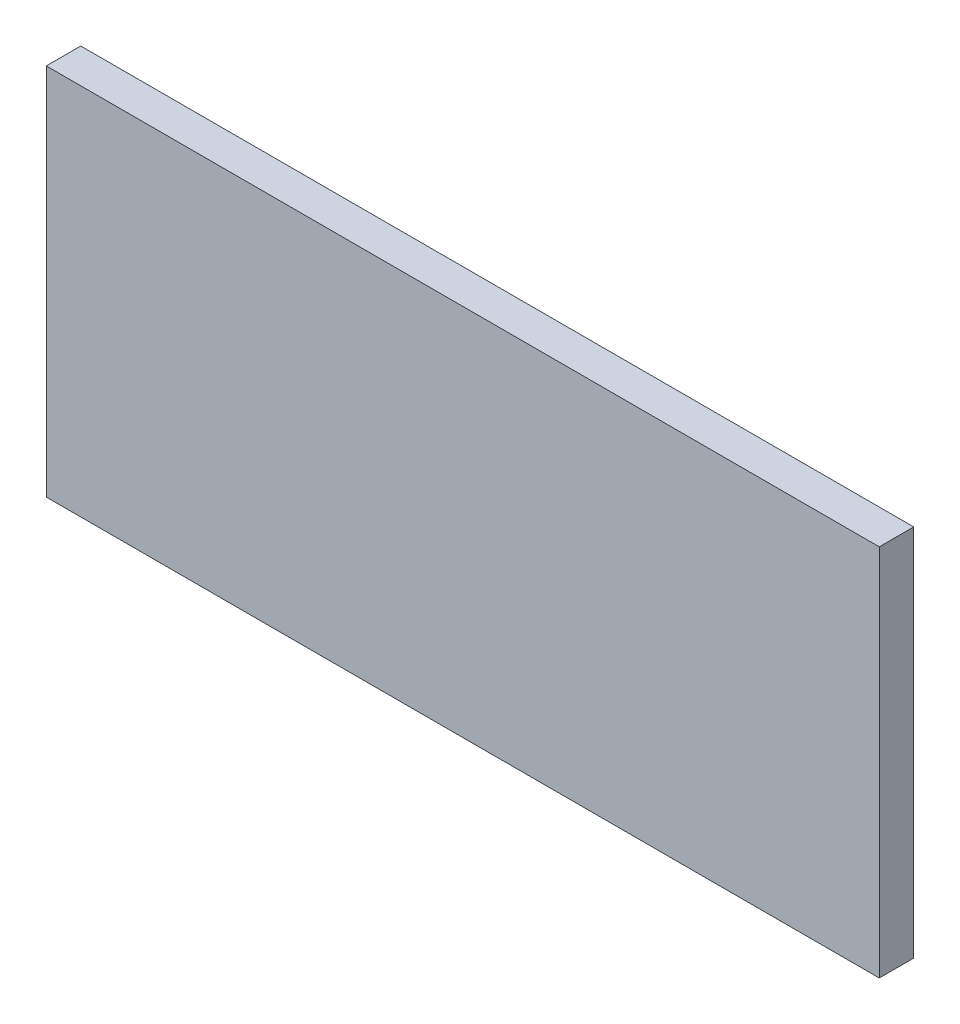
from build123d import *

# Parameters (mm, degrees)
ESQUISSE1_W      = 290
ESQUISSE1_H      = 130
EXTRUSION1_DEPTH = 12


with BuildPart() as part:
    # Esquisse1 → Extrusion1 (new body)
    with BuildSketch(Plane.XY):
        with Locations((145, 65)):
            Rectangle(ESQUISSE1_W, ESQUISSE1_H)
    extrude(amount=EXTRUSION1_DEPTH)


solid = part.part
